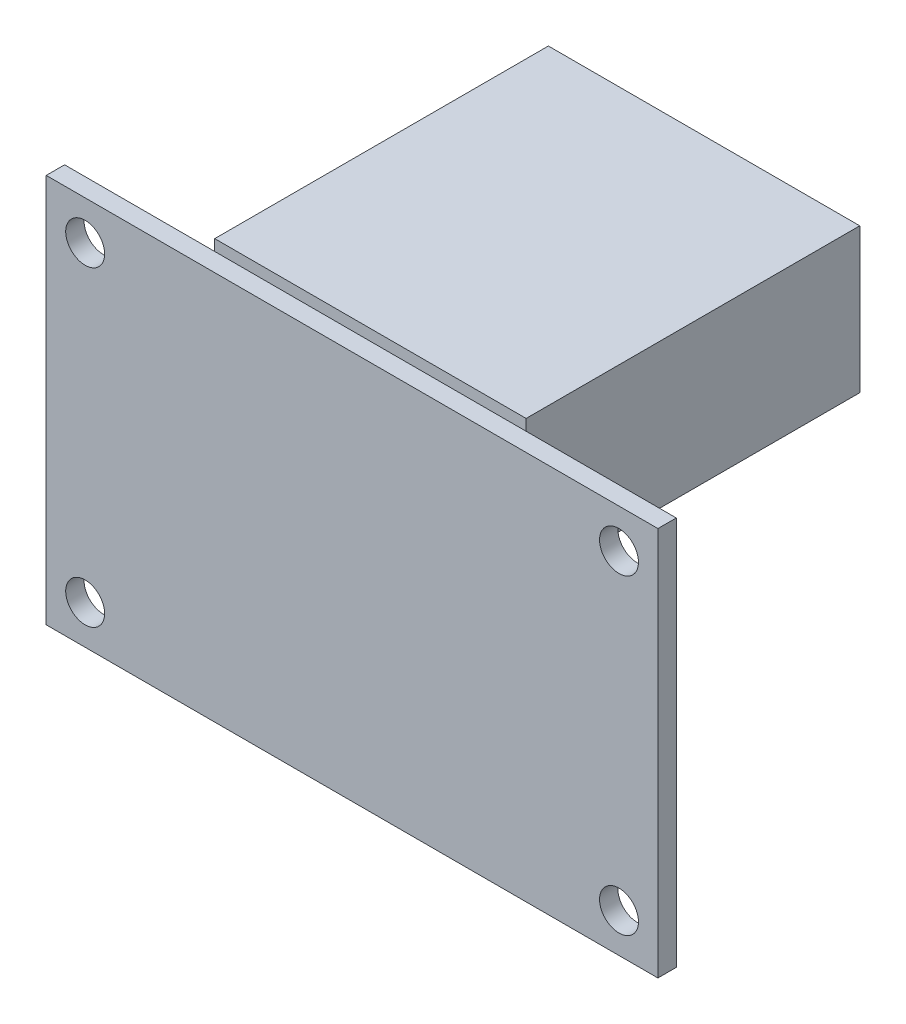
ISO-10303-21;
HEADER;
FILE_DESCRIPTION(('STEP AP214'),'2;1');
FILE_NAME('part.step','',(''),(''),'','','');
FILE_SCHEMA(('AUTOMOTIVE_DESIGN { 1 0 10303 214 1 1 1 1 }'));
ENDSEC;
DATA;
#1=APPLICATION_CONTEXT('core data for automotive mechanical design processes');
#2=APPLICATION_PROTOCOL_DEFINITION('international standard','automotive_design',2000,#1);
#3=PRODUCT_CONTEXT('',#1,'mechanical');
#4=PRODUCT('Part','Part','',(#3));
#5=PRODUCT_RELATED_PRODUCT_CATEGORY('part','',(#4));
#6=PRODUCT_DEFINITION_FORMATION('','',#4);
#7=PRODUCT_DEFINITION_CONTEXT('part definition',#1,'design');
#8=PRODUCT_DEFINITION('design','',#6,#7);
#9=PRODUCT_DEFINITION_SHAPE('','',#8);
#10=(LENGTH_UNIT() NAMED_UNIT(*) SI_UNIT(.MILLI.,.METRE.));
#11=(NAMED_UNIT(*) PLANE_ANGLE_UNIT() SI_UNIT($,.RADIAN.));
#12=(NAMED_UNIT(*) SI_UNIT($,.STERADIAN.) SOLID_ANGLE_UNIT());
#13=UNCERTAINTY_MEASURE_WITH_UNIT(LENGTH_MEASURE(1.E-05),#10,'distance_accuracy_value','');
#14=(GEOMETRIC_REPRESENTATION_CONTEXT(3) GLOBAL_UNCERTAINTY_ASSIGNED_CONTEXT((#13)) GLOBAL_UNIT_ASSIGNED_CONTEXT((#10,
#11,#12)) REPRESENTATION_CONTEXT('',''));
#15=CARTESIAN_POINT('',(0.,0.,0.));
#16=DIRECTION('',(0.,0.,1.));
#17=DIRECTION('',(1.,0.,0.));
#18=AXIS2_PLACEMENT_3D('',#15,#16,#17);
#19=CARTESIAN_POINT('',(0.,0.,0.));
#20=DIRECTION('',(0.,0.,1.));
#21=DIRECTION('',(1.,0.,0.));
#22=AXIS2_PLACEMENT_3D('',#19,#20,#21);
#23=PLANE('',#22);
#24=CARTESIAN_POINT('',(23.984767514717,-0.0594130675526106,0.));
#25=DIRECTION('',(0.,0.,1.));
#26=DIRECTION('',(1.,0.,0.));
#27=AXIS2_PLACEMENT_3D('',#24,#25,#26);
#28=CIRCLE('',#27,1.75);
#29=CARTESIAN_POINT('',(25.7347675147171,-0.0594130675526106,0.));
#30=VERTEX_POINT('',#29);
#31=EDGE_CURVE('E129',#30,#30,#28,.T.);
#32=ORIENTED_EDGE('',*,*,#31,.T.);
#33=EDGE_LOOP('',(#32));
#34=FACE_BOUND('',#33,.T.);
#35=CARTESIAN_POINT('',(-24.015232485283,-0.0594130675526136,0.));
#36=DIRECTION('',(0.,0.,1.));
#37=DIRECTION('',(1.,0.,0.));
#38=AXIS2_PLACEMENT_3D('',#35,#36,#37);
#39=CIRCLE('',#38,1.75);
#40=CARTESIAN_POINT('',(-22.2652324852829,-0.0594130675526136,0.));
#41=VERTEX_POINT('',#40);
#42=EDGE_CURVE('E144',#41,#41,#39,.T.);
#43=ORIENTED_EDGE('',*,*,#42,.T.);
#44=EDGE_LOOP('',(#43));
#45=FACE_BOUND('',#44,.T.);
#46=CARTESIAN_POINT('',(-24.015232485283,27.9405869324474,0.));
#47=DIRECTION('',(0.,0.,1.));
#48=DIRECTION('',(1.,0.,0.));
#49=AXIS2_PLACEMENT_3D('',#46,#47,#48);
#50=CIRCLE('',#49,1.75);
#51=CARTESIAN_POINT('',(-22.265232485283,27.9405869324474,0.));
#52=VERTEX_POINT('',#51);
#53=EDGE_CURVE('E150',#52,#52,#50,.T.);
#54=ORIENTED_EDGE('',*,*,#53,.T.);
#55=EDGE_LOOP('',(#54));
#56=FACE_BOUND('',#55,.T.);
#57=CARTESIAN_POINT('',(23.984767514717,27.9405869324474,0.));
#58=DIRECTION('',(0.,0.,1.));
#59=DIRECTION('',(1.,0.,0.));
#60=AXIS2_PLACEMENT_3D('',#57,#58,#59);
#61=CIRCLE('',#60,1.75);
#62=CARTESIAN_POINT('',(25.734767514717,27.9405869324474,0.));
#63=VERTEX_POINT('',#62);
#64=EDGE_CURVE('E139',#63,#63,#61,.T.);
#65=ORIENTED_EDGE('',*,*,#64,.T.);
#66=EDGE_LOOP('',(#65));
#67=FACE_BOUND('',#66,.T.);
#68=DIRECTION('',(0.,-1.,0.));
#69=VECTOR('',#68,1.);
#70=CARTESIAN_POINT('',(13.9847675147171,32.4405869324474,0.));
#71=LINE('',#70,#69);
#72=CARTESIAN_POINT('',(13.9847675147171,31.4405869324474,0.));
#73=VERTEX_POINT('',#72);
#74=CARTESIAN_POINT('',(13.9847675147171,19.4405869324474,0.));
#75=VERTEX_POINT('',#74);
#76=EDGE_CURVE('E11',#73,#75,#71,.T.);
#77=ORIENTED_EDGE('',*,*,#76,.F.);
#78=DIRECTION('',(-1.,0.,0.));
#79=VECTOR('',#78,1.);
#80=CARTESIAN_POINT('',(-27.515232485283,31.4405869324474,0.));
#81=LINE('',#80,#79);
#82=CARTESIAN_POINT('',(27.484767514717,31.4405869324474,0.));
#83=VERTEX_POINT('',#82);
#84=EDGE_CURVE('E163',#83,#73,#81,.T.);
#85=ORIENTED_EDGE('',*,*,#84,.F.);
#86=DIRECTION('',(0.,1.,0.));
#87=VECTOR('',#86,1.);
#88=CARTESIAN_POINT('',(27.484767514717,31.4405869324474,0.));
#89=LINE('',#88,#87);
#90=CARTESIAN_POINT('',(27.4847675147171,-3.55941306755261,0.));
#91=VERTEX_POINT('',#90);
#92=EDGE_CURVE('E174',#91,#83,#89,.T.);
#93=ORIENTED_EDGE('',*,*,#92,.F.);
#94=DIRECTION('',(1.,0.,0.));
#95=VECTOR('',#94,1.);
#96=CARTESIAN_POINT('',(-27.515232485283,-3.55941306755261,0.));
#97=LINE('',#96,#95);
#98=CARTESIAN_POINT('',(-27.515232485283,-3.55941306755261,0.));
#99=VERTEX_POINT('',#98);
#100=EDGE_CURVE('E172',#99,#91,#97,.T.);
#101=ORIENTED_EDGE('',*,*,#100,.F.);
#102=DIRECTION('',(0.,-1.,0.));
#103=VECTOR('',#102,1.);
#104=CARTESIAN_POINT('',(-27.515232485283,31.4405869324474,0.));
#105=LINE('',#104,#103);
#106=CARTESIAN_POINT('',(-27.515232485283,31.4405869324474,0.));
#107=VERTEX_POINT('',#106);
#108=EDGE_CURVE('E156',#107,#99,#105,.T.);
#109=ORIENTED_EDGE('',*,*,#108,.F.);
#110=CARTESIAN_POINT('',(-14.0152324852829,31.4405869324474,0.));
#111=VERTEX_POINT('',#110);
#112=EDGE_CURVE('E57',#111,#107,#81,.T.);
#113=ORIENTED_EDGE('',*,*,#112,.F.);
#114=DIRECTION('',(0.,1.,0.));
#115=VECTOR('',#114,1.);
#116=CARTESIAN_POINT('',(-14.0152324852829,32.4405869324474,0.));
#117=LINE('',#116,#115);
#118=CARTESIAN_POINT('',(-14.0152324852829,19.4405869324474,0.));
#119=VERTEX_POINT('',#118);
#120=EDGE_CURVE('E352',#119,#111,#117,.T.);
#121=ORIENTED_EDGE('',*,*,#120,.F.);
#122=DIRECTION('',(-1.,0.,0.));
#123=VECTOR('',#122,1.);
#124=CARTESIAN_POINT('',(13.9847675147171,19.4405869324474,0.));
#125=LINE('',#124,#123);
#126=EDGE_CURVE('E52',#75,#119,#125,.T.);
#127=ORIENTED_EDGE('',*,*,#126,.F.);
#128=EDGE_LOOP('',(#77,#85,#93,#101,#109,#113,#121,#127));
#129=FACE_BOUND('',#128,.T.);
#130=ADVANCED_FACE('F35',(#34,#45,#56,#67,#129),#23,.F.);
#131=CARTESIAN_POINT('',(0.,0.,1.65));
#132=DIRECTION('',(0.,0.,1.));
#133=DIRECTION('',(1.,0.,0.));
#134=AXIS2_PLACEMENT_3D('',#131,#132,#133);
#135=PLANE('',#134);
#136=CARTESIAN_POINT('',(23.984767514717,27.9405869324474,1.65));
#137=DIRECTION('',(0.,0.,1.));
#138=DIRECTION('',(1.,0.,0.));
#139=AXIS2_PLACEMENT_3D('',#136,#137,#138);
#140=CIRCLE('',#139,1.75);
#141=CARTESIAN_POINT('',(25.734767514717,27.9405869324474,1.65));
#142=VERTEX_POINT('',#141);
#143=EDGE_CURVE('E141',#142,#142,#140,.T.);
#144=ORIENTED_EDGE('',*,*,#143,.F.);
#145=EDGE_LOOP('',(#144));
#146=FACE_BOUND('',#145,.T.);
#147=CARTESIAN_POINT('',(-24.015232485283,27.9405869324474,1.65));
#148=DIRECTION('',(0.,0.,1.));
#149=DIRECTION('',(1.,0.,0.));
#150=AXIS2_PLACEMENT_3D('',#147,#148,#149);
#151=CIRCLE('',#150,1.75);
#152=CARTESIAN_POINT('',(-22.265232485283,27.9405869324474,1.65));
#153=VERTEX_POINT('',#152);
#154=EDGE_CURVE('E153',#153,#153,#151,.T.);
#155=ORIENTED_EDGE('',*,*,#154,.F.);
#156=EDGE_LOOP('',(#155));
#157=FACE_BOUND('',#156,.T.);
#158=DIRECTION('',(0.,-1.,0.));
#159=VECTOR('',#158,1.);
#160=CARTESIAN_POINT('',(-27.515232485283,31.4405869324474,1.65));
#161=LINE('',#160,#159);
#162=CARTESIAN_POINT('',(-27.515232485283,31.4405869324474,1.65));
#163=VERTEX_POINT('',#162);
#164=CARTESIAN_POINT('',(-27.515232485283,-3.55941306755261,1.65));
#165=VERTEX_POINT('',#164);
#166=EDGE_CURVE('E159',#163,#165,#161,.T.);
#167=ORIENTED_EDGE('',*,*,#166,.T.);
#168=DIRECTION('',(1.,0.,0.));
#169=VECTOR('',#168,1.);
#170=CARTESIAN_POINT('',(-27.515232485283,-3.55941306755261,1.65));
#171=LINE('',#170,#169);
#172=CARTESIAN_POINT('',(27.4847675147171,-3.55941306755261,1.65));
#173=VERTEX_POINT('',#172);
#174=EDGE_CURVE('E162',#165,#173,#171,.T.);
#175=ORIENTED_EDGE('',*,*,#174,.T.);
#176=DIRECTION('',(0.,1.,0.));
#177=VECTOR('',#176,1.);
#178=CARTESIAN_POINT('',(27.484767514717,31.4405869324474,1.65));
#179=LINE('',#178,#177);
#180=CARTESIAN_POINT('',(27.484767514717,31.4405869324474,1.65));
#181=VERTEX_POINT('',#180);
#182=EDGE_CURVE('E165',#173,#181,#179,.T.);
#183=ORIENTED_EDGE('',*,*,#182,.T.);
#184=DIRECTION('',(-1.,0.,0.));
#185=VECTOR('',#184,1.);
#186=CARTESIAN_POINT('',(-27.515232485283,31.4405869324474,1.65));
#187=LINE('',#186,#185);
#188=EDGE_CURVE('E167',#181,#163,#187,.T.);
#189=ORIENTED_EDGE('',*,*,#188,.T.);
#190=EDGE_LOOP('',(#167,#175,#183,#189));
#191=FACE_BOUND('',#190,.T.);
#192=CARTESIAN_POINT('',(-24.015232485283,-0.0594130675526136,1.65));
#193=DIRECTION('',(0.,0.,1.));
#194=DIRECTION('',(1.,0.,0.));
#195=AXIS2_PLACEMENT_3D('',#192,#193,#194);
#196=CIRCLE('',#195,1.75);
#197=CARTESIAN_POINT('',(-22.2652324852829,-0.0594130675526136,1.65));
#198=VERTEX_POINT('',#197);
#199=EDGE_CURVE('E147',#198,#198,#196,.T.);
#200=ORIENTED_EDGE('',*,*,#199,.F.);
#201=EDGE_LOOP('',(#200));
#202=FACE_BOUND('',#201,.T.);
#203=CARTESIAN_POINT('',(23.984767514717,-0.0594130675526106,1.65));
#204=DIRECTION('',(0.,0.,1.));
#205=DIRECTION('',(1.,0.,0.));
#206=AXIS2_PLACEMENT_3D('',#203,#204,#205);
#207=CIRCLE('',#206,1.75);
#208=CARTESIAN_POINT('',(25.7347675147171,-0.0594130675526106,1.65));
#209=VERTEX_POINT('',#208);
#210=EDGE_CURVE('E132',#209,#209,#207,.T.);
#211=ORIENTED_EDGE('',*,*,#210,.F.);
#212=EDGE_LOOP('',(#211));
#213=FACE_BOUND('',#212,.T.);
#214=ADVANCED_FACE('F204',(#146,#157,#191,#202,#213),#135,.T.);
#215=CARTESIAN_POINT('',(-27.515232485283,31.4405869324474,1.65));
#216=DIRECTION('',(1.,0.,0.));
#217=DIRECTION('',(0.,1.,0.));
#218=AXIS2_PLACEMENT_3D('',#215,#216,#217);
#219=PLANE('',#218);
#220=ORIENTED_EDGE('',*,*,#108,.T.);
#221=DIRECTION('',(0.,0.,-1.));
#222=VECTOR('',#221,1.);
#223=CARTESIAN_POINT('',(-27.515232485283,-3.55941306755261,1.65));
#224=LINE('',#223,#222);
#225=EDGE_CURVE('E39',#165,#99,#224,.T.);
#226=ORIENTED_EDGE('',*,*,#225,.F.);
#227=ORIENTED_EDGE('',*,*,#166,.F.);
#228=DIRECTION('',(0.,0.,-1.));
#229=VECTOR('',#228,1.);
#230=CARTESIAN_POINT('',(-27.515232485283,31.4405869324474,1.65));
#231=LINE('',#230,#229);
#232=EDGE_CURVE('E169',#163,#107,#231,.T.);
#233=ORIENTED_EDGE('',*,*,#232,.T.);
#234=EDGE_LOOP('',(#220,#226,#227,#233));
#235=FACE_BOUND('',#234,.T.);
#236=ADVANCED_FACE('F37',(#235),#219,.F.);
#237=CARTESIAN_POINT('',(-27.515232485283,-3.55941306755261,1.65));
#238=DIRECTION('',(0.,1.,0.));
#239=DIRECTION('',(0.,0.,1.));
#240=AXIS2_PLACEMENT_3D('',#237,#238,#239);
#241=PLANE('',#240);
#242=ORIENTED_EDGE('',*,*,#100,.T.);
#243=DIRECTION('',(0.,0.,-1.));
#244=VECTOR('',#243,1.);
#245=CARTESIAN_POINT('',(27.4847675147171,-3.55941306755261,1.65));
#246=LINE('',#245,#244);
#247=EDGE_CURVE('E183',#173,#91,#246,.T.);
#248=ORIENTED_EDGE('',*,*,#247,.F.);
#249=ORIENTED_EDGE('',*,*,#174,.F.);
#250=ORIENTED_EDGE('',*,*,#225,.T.);
#251=EDGE_LOOP('',(#242,#248,#249,#250));
#252=FACE_BOUND('',#251,.T.);
#253=ADVANCED_FACE('F192',(#252),#241,.F.);
#254=CARTESIAN_POINT('',(27.484767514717,31.4405869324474,1.65));
#255=DIRECTION('',(-1.,0.,0.));
#256=DIRECTION('',(0.,-1.,0.));
#257=AXIS2_PLACEMENT_3D('',#254,#255,#256);
#258=PLANE('',#257);
#259=ORIENTED_EDGE('',*,*,#92,.T.);
#260=DIRECTION('',(0.,0.,-1.));
#261=VECTOR('',#260,1.);
#262=CARTESIAN_POINT('',(27.484767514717,31.4405869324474,1.65));
#263=LINE('',#262,#261);
#264=EDGE_CURVE('E181',#181,#83,#263,.T.);
#265=ORIENTED_EDGE('',*,*,#264,.F.);
#266=ORIENTED_EDGE('',*,*,#182,.F.);
#267=ORIENTED_EDGE('',*,*,#247,.T.);
#268=EDGE_LOOP('',(#259,#265,#266,#267));
#269=FACE_BOUND('',#268,.T.);
#270=ADVANCED_FACE('F198',(#269),#258,.F.);
#271=CARTESIAN_POINT('',(-27.515232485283,31.4405869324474,1.65));
#272=DIRECTION('',(0.,-1.,0.));
#273=DIRECTION('',(0.,0.,-1.));
#274=AXIS2_PLACEMENT_3D('',#271,#272,#273);
#275=PLANE('',#274);
#276=ORIENTED_EDGE('',*,*,#84,.T.);
#277=EDGE_CURVE('E178',#73,#111,#81,.T.);
#278=ORIENTED_EDGE('',*,*,#277,.T.);
#279=ORIENTED_EDGE('',*,*,#112,.T.);
#280=ORIENTED_EDGE('',*,*,#232,.F.);
#281=ORIENTED_EDGE('',*,*,#188,.F.);
#282=ORIENTED_EDGE('',*,*,#264,.T.);
#283=EDGE_LOOP('',(#276,#278,#279,#280,#281,#282));
#284=FACE_BOUND('',#283,.T.);
#285=ADVANCED_FACE('F201',(#284),#275,.F.);
#286=CARTESIAN_POINT('',(-24.015232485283,27.9405869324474,1.65));
#287=DIRECTION('',(0.,0.,-1.));
#288=DIRECTION('',(-1.,0.,0.));
#289=AXIS2_PLACEMENT_3D('',#286,#287,#288);
#290=CYLINDRICAL_SURFACE('',#289,1.75);
#291=ORIENTED_EDGE('',*,*,#154,.T.);
#292=EDGE_LOOP('',(#291));
#293=FACE_BOUND('',#292,.T.);
#294=ORIENTED_EDGE('',*,*,#53,.F.);
#295=EDGE_LOOP('',(#294));
#296=FACE_BOUND('',#295,.T.);
#297=ADVANCED_FACE('F236',(#293,#296),#290,.F.);
#298=CARTESIAN_POINT('',(-24.015232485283,-0.0594130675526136,1.65));
#299=DIRECTION('',(0.,0.,-1.));
#300=DIRECTION('',(-1.,0.,0.));
#301=AXIS2_PLACEMENT_3D('',#298,#299,#300);
#302=CYLINDRICAL_SURFACE('',#301,1.75);
#303=ORIENTED_EDGE('',*,*,#199,.T.);
#304=EDGE_LOOP('',(#303));
#305=FACE_BOUND('',#304,.T.);
#306=ORIENTED_EDGE('',*,*,#42,.F.);
#307=EDGE_LOOP('',(#306));
#308=FACE_BOUND('',#307,.T.);
#309=ADVANCED_FACE('F230',(#305,#308),#302,.F.);
#310=CARTESIAN_POINT('',(23.984767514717,27.9405869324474,1.65));
#311=DIRECTION('',(0.,0.,-1.));
#312=DIRECTION('',(-1.,0.,0.));
#313=AXIS2_PLACEMENT_3D('',#310,#311,#312);
#314=CYLINDRICAL_SURFACE('',#313,1.75);
#315=ORIENTED_EDGE('',*,*,#143,.T.);
#316=EDGE_LOOP('',(#315));
#317=FACE_BOUND('',#316,.T.);
#318=ORIENTED_EDGE('',*,*,#64,.F.);
#319=EDGE_LOOP('',(#318));
#320=FACE_BOUND('',#319,.T.);
#321=ADVANCED_FACE('F216',(#317,#320),#314,.F.);
#322=CARTESIAN_POINT('',(23.984767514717,-0.0594130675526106,1.65));
#323=DIRECTION('',(0.,0.,-1.));
#324=DIRECTION('',(-1.,0.,0.));
#325=AXIS2_PLACEMENT_3D('',#322,#323,#324);
#326=CYLINDRICAL_SURFACE('',#325,1.75);
#327=ORIENTED_EDGE('',*,*,#210,.T.);
#328=EDGE_LOOP('',(#327));
#329=FACE_BOUND('',#328,.T.);
#330=ORIENTED_EDGE('',*,*,#31,.F.);
#331=EDGE_LOOP('',(#330));
#332=FACE_BOUND('',#331,.T.);
#333=ADVANCED_FACE('F213',(#329,#332),#326,.F.);
#334=CARTESIAN_POINT('',(13.9847675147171,32.4405869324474,-30.));
#335=DIRECTION('',(-1.,0.,0.));
#336=DIRECTION('',(0.,-1.,0.));
#337=AXIS2_PLACEMENT_3D('',#334,#335,#336);
#338=PLANE('',#337);
#339=CARTESIAN_POINT('',(13.9847675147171,32.4405869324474,0.));
#340=VERTEX_POINT('',#339);
#341=EDGE_CURVE('E45',#340,#73,#71,.T.);
#342=ORIENTED_EDGE('',*,*,#341,.T.);
#343=ORIENTED_EDGE('',*,*,#76,.T.);
#344=DIRECTION('',(0.,0.,1.));
#345=VECTOR('',#344,1.);
#346=CARTESIAN_POINT('',(13.9847675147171,19.4405869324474,-30.));
#347=LINE('',#346,#345);
#348=CARTESIAN_POINT('',(13.9847675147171,19.4405869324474,-30.));
#349=VERTEX_POINT('',#348);
#350=EDGE_CURVE('E110',#349,#75,#347,.T.);
#351=ORIENTED_EDGE('',*,*,#350,.F.);
#352=DIRECTION('',(0.,-1.,0.));
#353=VECTOR('',#352,1.);
#354=CARTESIAN_POINT('',(13.9847675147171,32.4405869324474,-30.));
#355=LINE('',#354,#353);
#356=CARTESIAN_POINT('',(13.9847675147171,32.4405869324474,-30.));
#357=VERTEX_POINT('',#356);
#358=EDGE_CURVE('E116',#357,#349,#355,.T.);
#359=ORIENTED_EDGE('',*,*,#358,.F.);
#360=DIRECTION('',(0.,0.,1.));
#361=VECTOR('',#360,1.);
#362=CARTESIAN_POINT('',(13.9847675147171,32.4405869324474,-30.));
#363=LINE('',#362,#361);
#364=EDGE_CURVE('E347',#357,#340,#363,.T.);
#365=ORIENTED_EDGE('',*,*,#364,.T.);
#366=EDGE_LOOP('',(#342,#343,#351,#359,#365));
#367=FACE_BOUND('',#366,.T.);
#368=ADVANCED_FACE('F128',(#367),#338,.F.);
#369=CARTESIAN_POINT('',(13.9847675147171,19.4405869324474,-30.));
#370=DIRECTION('',(0.,1.,0.));
#371=DIRECTION('',(0.,0.,1.));
#372=AXIS2_PLACEMENT_3D('',#369,#370,#371);
#373=PLANE('',#372);
#374=ORIENTED_EDGE('',*,*,#126,.T.);
#375=DIRECTION('',(0.,0.,1.));
#376=VECTOR('',#375,1.);
#377=CARTESIAN_POINT('',(-14.0152324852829,19.4405869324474,-30.));
#378=LINE('',#377,#376);
#379=CARTESIAN_POINT('',(-14.0152324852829,19.4405869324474,-30.));
#380=VERTEX_POINT('',#379);
#381=EDGE_CURVE('E112',#380,#119,#378,.T.);
#382=ORIENTED_EDGE('',*,*,#381,.F.);
#383=DIRECTION('',(-1.,0.,0.));
#384=VECTOR('',#383,1.);
#385=CARTESIAN_POINT('',(13.9847675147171,19.4405869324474,-30.));
#386=LINE('',#385,#384);
#387=EDGE_CURVE('E106',#349,#380,#386,.T.);
#388=ORIENTED_EDGE('',*,*,#387,.F.);
#389=ORIENTED_EDGE('',*,*,#350,.T.);
#390=EDGE_LOOP('',(#374,#382,#388,#389));
#391=FACE_BOUND('',#390,.T.);
#392=ADVANCED_FACE('F108',(#391),#373,.F.);
#393=CARTESIAN_POINT('',(-14.0152324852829,32.4405869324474,-30.));
#394=DIRECTION('',(1.,0.,0.));
#395=DIRECTION('',(0.,0.,-1.));
#396=AXIS2_PLACEMENT_3D('',#393,#394,#395);
#397=PLANE('',#396);
#398=ORIENTED_EDGE('',*,*,#120,.T.);
#399=CARTESIAN_POINT('',(-14.0152324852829,32.4405869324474,0.));
#400=VERTEX_POINT('',#399);
#401=EDGE_CURVE('E345',#111,#400,#117,.T.);
#402=ORIENTED_EDGE('',*,*,#401,.T.);
#403=DIRECTION('',(0.,0.,1.));
#404=VECTOR('',#403,1.);
#405=CARTESIAN_POINT('',(-14.0152324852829,32.4405869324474,-30.));
#406=LINE('',#405,#404);
#407=CARTESIAN_POINT('',(-14.0152324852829,32.4405869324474,-30.));
#408=VERTEX_POINT('',#407);
#409=EDGE_CURVE('E134',#408,#400,#406,.T.);
#410=ORIENTED_EDGE('',*,*,#409,.F.);
#411=DIRECTION('',(0.,1.,0.));
#412=VECTOR('',#411,1.);
#413=CARTESIAN_POINT('',(-14.0152324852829,32.4405869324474,-30.));
#414=LINE('',#413,#412);
#415=EDGE_CURVE('E115',#380,#408,#414,.T.);
#416=ORIENTED_EDGE('',*,*,#415,.F.);
#417=ORIENTED_EDGE('',*,*,#381,.T.);
#418=EDGE_LOOP('',(#398,#402,#410,#416,#417));
#419=FACE_BOUND('',#418,.T.);
#420=ADVANCED_FACE('F291',(#419),#397,.F.);
#421=CARTESIAN_POINT('',(13.9847675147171,32.4405869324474,-30.));
#422=DIRECTION('',(0.,-1.,0.));
#423=DIRECTION('',(1.,0.,0.));
#424=AXIS2_PLACEMENT_3D('',#421,#422,#423);
#425=PLANE('',#424);
#426=DIRECTION('',(1.,0.,0.));
#427=VECTOR('',#426,1.);
#428=CARTESIAN_POINT('',(13.9847675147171,32.4405869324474,0.));
#429=LINE('',#428,#427);
#430=EDGE_CURVE('E125',#400,#340,#429,.T.);
#431=ORIENTED_EDGE('',*,*,#430,.T.);
#432=ORIENTED_EDGE('',*,*,#364,.F.);
#433=DIRECTION('',(1.,0.,0.));
#434=VECTOR('',#433,1.);
#435=CARTESIAN_POINT('',(13.9847675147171,32.4405869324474,-30.));
#436=LINE('',#435,#434);
#437=EDGE_CURVE('E121',#408,#357,#436,.T.);
#438=ORIENTED_EDGE('',*,*,#437,.F.);
#439=ORIENTED_EDGE('',*,*,#409,.T.);
#440=EDGE_LOOP('',(#431,#432,#438,#439));
#441=FACE_BOUND('',#440,.T.);
#442=ADVANCED_FACE('F302',(#441),#425,.F.);
#443=CARTESIAN_POINT('',(0.,0.,-30.));
#444=DIRECTION('',(0.,0.,-1.));
#445=DIRECTION('',(-1.,0.,0.));
#446=AXIS2_PLACEMENT_3D('',#443,#444,#445);
#447=PLANE('',#446);
#448=ORIENTED_EDGE('',*,*,#358,.T.);
#449=ORIENTED_EDGE('',*,*,#387,.T.);
#450=ORIENTED_EDGE('',*,*,#415,.T.);
#451=ORIENTED_EDGE('',*,*,#437,.T.);
#452=EDGE_LOOP('',(#448,#449,#450,#451));
#453=FACE_BOUND('',#452,.T.);
#454=ADVANCED_FACE('F119',(#453),#447,.T.);
#455=CARTESIAN_POINT('',(0.,0.,0.));
#456=DIRECTION('',(0.,0.,-1.));
#457=DIRECTION('',(-1.,0.,0.));
#458=AXIS2_PLACEMENT_3D('',#455,#456,#457);
#459=PLANE('',#458);
#460=ORIENTED_EDGE('',*,*,#277,.F.);
#461=ORIENTED_EDGE('',*,*,#341,.F.);
#462=ORIENTED_EDGE('',*,*,#430,.F.);
#463=ORIENTED_EDGE('',*,*,#401,.F.);
#464=EDGE_LOOP('',(#460,#461,#462,#463));
#465=FACE_BOUND('',#464,.T.);
#466=ADVANCED_FACE('F322',(#465),#459,.F.);
#467=CLOSED_SHELL('',(#130,#214,#236,#253,#270,#285,#297,#309,#321,#333,#368,#392,#420,#442,
#454,#466));
#468=MANIFOLD_SOLID_BREP('B2',#467);
#469=ADVANCED_BREP_SHAPE_REPRESENTATION('',(#18,#468),#14);
#470=SHAPE_DEFINITION_REPRESENTATION(#9,#469);
ENDSEC;
END-ISO-10303-21;
